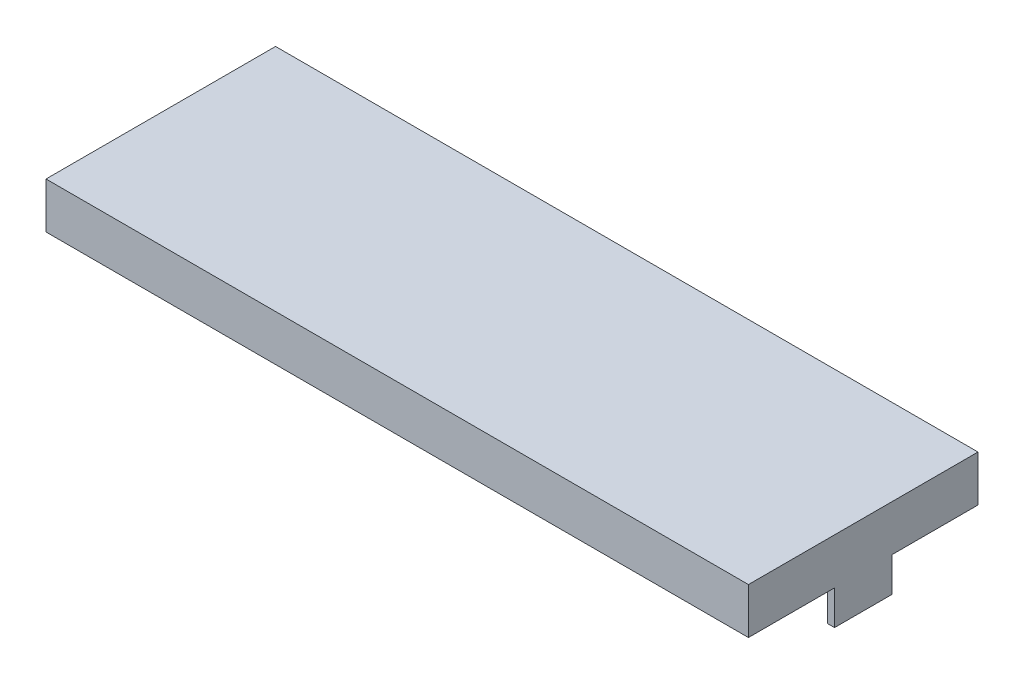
ISO-10303-21;
HEADER;
FILE_DESCRIPTION(('STEP AP214'),'2;1');
FILE_NAME('part.step','',(''),(''),'','','');
FILE_SCHEMA(('AUTOMOTIVE_DESIGN { 1 0 10303 214 1 1 1 1 }'));
ENDSEC;
DATA;
#1=APPLICATION_CONTEXT('core data for automotive mechanical design processes');
#2=APPLICATION_PROTOCOL_DEFINITION('international standard','automotive_design',2000,#1);
#3=PRODUCT_CONTEXT('',#1,'mechanical');
#4=PRODUCT('Part','Part','',(#3));
#5=PRODUCT_RELATED_PRODUCT_CATEGORY('part','',(#4));
#6=PRODUCT_DEFINITION_FORMATION('','',#4);
#7=PRODUCT_DEFINITION_CONTEXT('part definition',#1,'design');
#8=PRODUCT_DEFINITION('design','',#6,#7);
#9=PRODUCT_DEFINITION_SHAPE('','',#8);
#10=(LENGTH_UNIT() NAMED_UNIT(*) SI_UNIT(.MILLI.,.METRE.));
#11=(NAMED_UNIT(*) PLANE_ANGLE_UNIT() SI_UNIT($,.RADIAN.));
#12=(NAMED_UNIT(*) SI_UNIT($,.STERADIAN.) SOLID_ANGLE_UNIT());
#13=UNCERTAINTY_MEASURE_WITH_UNIT(LENGTH_MEASURE(1.E-05),#10,'distance_accuracy_value','');
#14=(GEOMETRIC_REPRESENTATION_CONTEXT(3) GLOBAL_UNCERTAINTY_ASSIGNED_CONTEXT((#13)) GLOBAL_UNIT_ASSIGNED_CONTEXT((#10,
#11,#12)) REPRESENTATION_CONTEXT('',''));
#15=CARTESIAN_POINT('',(0.,0.,0.));
#16=DIRECTION('',(0.,0.,1.));
#17=DIRECTION('',(1.,0.,0.));
#18=AXIS2_PLACEMENT_3D('',#15,#16,#17);
#19=CARTESIAN_POINT('',(-153.,-10.,50.));
#20=DIRECTION('',(0.,1.,0.));
#21=DIRECTION('',(0.,0.,1.));
#22=AXIS2_PLACEMENT_3D('',#19,#20,#21);
#23=PLANE('',#22);
#24=DIRECTION('',(-1.,0.,0.));
#25=VECTOR('',#24,1.);
#26=CARTESIAN_POINT('',(153.,-10.,12.5));
#27=LINE('',#26,#25);
#28=CARTESIAN_POINT('',(153.,-10.,12.5));
#29=VERTEX_POINT('',#28);
#30=CARTESIAN_POINT('',(150.,-10.,12.5));
#31=VERTEX_POINT('',#30);
#32=EDGE_CURVE('E241',#29,#31,#27,.T.);
#33=ORIENTED_EDGE('',*,*,#32,.F.);
#34=DIRECTION('',(0.,0.,-1.));
#35=VECTOR('',#34,1.);
#36=CARTESIAN_POINT('',(153.,-10.,50.));
#37=LINE('',#36,#35);
#38=CARTESIAN_POINT('',(153.,-10.,50.));
#39=VERTEX_POINT('',#38);
#40=EDGE_CURVE('E142',#39,#29,#37,.T.);
#41=ORIENTED_EDGE('',*,*,#40,.F.);
#42=DIRECTION('',(1.,0.,0.));
#43=VECTOR('',#42,1.);
#44=CARTESIAN_POINT('',(-153.,-10.,50.));
#45=LINE('',#44,#43);
#46=CARTESIAN_POINT('',(-153.,-10.,50.));
#47=VERTEX_POINT('',#46);
#48=EDGE_CURVE('E192',#47,#39,#45,.T.);
#49=ORIENTED_EDGE('',*,*,#48,.F.);
#50=DIRECTION('',(0.,0.,-1.));
#51=VECTOR('',#50,1.);
#52=CARTESIAN_POINT('',(-153.,-10.,50.));
#53=LINE('',#52,#51);
#54=CARTESIAN_POINT('',(-153.,-10.,12.5));
#55=VERTEX_POINT('',#54);
#56=EDGE_CURVE('E11',#47,#55,#53,.T.);
#57=ORIENTED_EDGE('',*,*,#56,.T.);
#58=DIRECTION('',(-1.,0.,0.));
#59=VECTOR('',#58,1.);
#60=CARTESIAN_POINT('',(-153.,-10.,12.5));
#61=LINE('',#60,#59);
#62=CARTESIAN_POINT('',(-150.,-10.,12.5));
#63=VERTEX_POINT('',#62);
#64=EDGE_CURVE('E54',#63,#55,#61,.T.);
#65=ORIENTED_EDGE('',*,*,#64,.F.);
#66=DIRECTION('',(0.,0.,1.));
#67=VECTOR('',#66,1.);
#68=CARTESIAN_POINT('',(-150.,-10.,-12.5));
#69=LINE('',#68,#67);
#70=CARTESIAN_POINT('',(-150.,-10.,-12.5));
#71=VERTEX_POINT('',#70);
#72=EDGE_CURVE('E146',#71,#63,#69,.T.);
#73=ORIENTED_EDGE('',*,*,#72,.F.);
#74=DIRECTION('',(1.,0.,0.));
#75=VECTOR('',#74,1.);
#76=CARTESIAN_POINT('',(-153.,-10.,-12.5));
#77=LINE('',#76,#75);
#78=CARTESIAN_POINT('',(-153.,-10.,-12.5));
#79=VERTEX_POINT('',#78);
#80=EDGE_CURVE('E143',#79,#71,#77,.T.);
#81=ORIENTED_EDGE('',*,*,#80,.F.);
#82=CARTESIAN_POINT('',(-153.,-10.,-50.));
#83=VERTEX_POINT('',#82);
#84=EDGE_CURVE('E39',#79,#83,#53,.T.);
#85=ORIENTED_EDGE('',*,*,#84,.T.);
#86=DIRECTION('',(1.,0.,0.));
#87=VECTOR('',#86,1.);
#88=CARTESIAN_POINT('',(-153.,-10.,-50.));
#89=LINE('',#88,#87);
#90=CARTESIAN_POINT('',(153.,-10.,-50.));
#91=VERTEX_POINT('',#90);
#92=EDGE_CURVE('E202',#83,#91,#89,.T.);
#93=ORIENTED_EDGE('',*,*,#92,.T.);
#94=CARTESIAN_POINT('',(153.,-10.,-12.5));
#95=VERTEX_POINT('',#94);
#96=EDGE_CURVE('E213',#95,#91,#37,.T.);
#97=ORIENTED_EDGE('',*,*,#96,.F.);
#98=DIRECTION('',(1.,0.,0.));
#99=VECTOR('',#98,1.);
#100=CARTESIAN_POINT('',(153.,-10.,-12.5));
#101=LINE('',#100,#99);
#102=CARTESIAN_POINT('',(150.,-10.,-12.5));
#103=VERTEX_POINT('',#102);
#104=EDGE_CURVE('E136',#103,#95,#101,.T.);
#105=ORIENTED_EDGE('',*,*,#104,.F.);
#106=DIRECTION('',(0.,0.,-1.));
#107=VECTOR('',#106,1.);
#108=CARTESIAN_POINT('',(150.,-10.,-12.5));
#109=LINE('',#108,#107);
#110=EDGE_CURVE('E237',#31,#103,#109,.T.);
#111=ORIENTED_EDGE('',*,*,#110,.F.);
#112=EDGE_LOOP('',(#33,#41,#49,#57,#65,#73,#81,#85,#93,#97,#105,#111));
#113=FACE_BOUND('',#112,.T.);
#114=ADVANCED_FACE('F30',(#113),#23,.F.);
#115=CARTESIAN_POINT('',(-153.,-10.,50.));
#116=DIRECTION('',(1.,0.,0.));
#117=DIRECTION('',(0.,0.,-1.));
#118=AXIS2_PLACEMENT_3D('',#115,#116,#117);
#119=PLANE('',#118);
#120=DIRECTION('',(0.,-1.,0.));
#121=VECTOR('',#120,1.);
#122=CARTESIAN_POINT('',(-153.,-10.,-50.));
#123=LINE('',#122,#121);
#124=CARTESIAN_POINT('',(-153.,10.,-50.));
#125=VERTEX_POINT('',#124);
#126=EDGE_CURVE('E187',#125,#83,#123,.T.);
#127=ORIENTED_EDGE('',*,*,#126,.T.);
#128=ORIENTED_EDGE('',*,*,#84,.F.);
#129=DIRECTION('',(0.,1.,0.));
#130=VECTOR('',#129,1.);
#131=CARTESIAN_POINT('',(-153.,-25.,-12.5));
#132=LINE('',#131,#130);
#133=CARTESIAN_POINT('',(-153.,-25.,-12.5));
#134=VERTEX_POINT('',#133);
#135=EDGE_CURVE('E182',#134,#79,#132,.T.);
#136=ORIENTED_EDGE('',*,*,#135,.F.);
#137=DIRECTION('',(0.,0.,-1.));
#138=VECTOR('',#137,1.);
#139=CARTESIAN_POINT('',(-153.,-25.,-12.5));
#140=LINE('',#139,#138);
#141=CARTESIAN_POINT('',(-153.,-25.,12.5));
#142=VERTEX_POINT('',#141);
#143=EDGE_CURVE('E152',#142,#134,#140,.T.);
#144=ORIENTED_EDGE('',*,*,#143,.F.);
#145=DIRECTION('',(0.,1.,0.));
#146=VECTOR('',#145,1.);
#147=CARTESIAN_POINT('',(-153.,-25.,12.5));
#148=LINE('',#147,#146);
#149=EDGE_CURVE('E161',#142,#55,#148,.T.);
#150=ORIENTED_EDGE('',*,*,#149,.T.);
#151=ORIENTED_EDGE('',*,*,#56,.F.);
#152=DIRECTION('',(0.,-1.,0.));
#153=VECTOR('',#152,1.);
#154=CARTESIAN_POINT('',(-153.,-10.,50.));
#155=LINE('',#154,#153);
#156=CARTESIAN_POINT('',(-153.,10.,50.));
#157=VERTEX_POINT('',#156);
#158=EDGE_CURVE('E189',#157,#47,#155,.T.);
#159=ORIENTED_EDGE('',*,*,#158,.F.);
#160=DIRECTION('',(0.,0.,-1.));
#161=VECTOR('',#160,1.);
#162=CARTESIAN_POINT('',(-153.,10.,50.));
#163=LINE('',#162,#161);
#164=EDGE_CURVE('E199',#157,#125,#163,.T.);
#165=ORIENTED_EDGE('',*,*,#164,.T.);
#166=EDGE_LOOP('',(#127,#128,#136,#144,#150,#151,#159,#165));
#167=FACE_BOUND('',#166,.T.);
#168=ADVANCED_FACE('F32',(#167),#119,.F.);
#169=CARTESIAN_POINT('',(153.,-10.,50.));
#170=DIRECTION('',(-1.,0.,0.));
#171=DIRECTION('',(0.,0.,1.));
#172=AXIS2_PLACEMENT_3D('',#169,#170,#171);
#173=PLANE('',#172);
#174=DIRECTION('',(0.,1.,0.));
#175=VECTOR('',#174,1.);
#176=CARTESIAN_POINT('',(153.,-10.,-50.));
#177=LINE('',#176,#175);
#178=CARTESIAN_POINT('',(153.,10.,-50.));
#179=VERTEX_POINT('',#178);
#180=EDGE_CURVE('E205',#91,#179,#177,.T.);
#181=ORIENTED_EDGE('',*,*,#180,.T.);
#182=DIRECTION('',(0.,0.,-1.));
#183=VECTOR('',#182,1.);
#184=CARTESIAN_POINT('',(153.,10.,50.));
#185=LINE('',#184,#183);
#186=CARTESIAN_POINT('',(153.,10.,50.));
#187=VERTEX_POINT('',#186);
#188=EDGE_CURVE('E210',#187,#179,#185,.T.);
#189=ORIENTED_EDGE('',*,*,#188,.F.);
#190=DIRECTION('',(0.,1.,0.));
#191=VECTOR('',#190,1.);
#192=CARTESIAN_POINT('',(153.,-10.,50.));
#193=LINE('',#192,#191);
#194=EDGE_CURVE('E195',#39,#187,#193,.T.);
#195=ORIENTED_EDGE('',*,*,#194,.F.);
#196=ORIENTED_EDGE('',*,*,#40,.T.);
#197=DIRECTION('',(0.,1.,0.));
#198=VECTOR('',#197,1.);
#199=CARTESIAN_POINT('',(153.,-25.,12.5));
#200=LINE('',#199,#198);
#201=CARTESIAN_POINT('',(153.,-25.,12.5));
#202=VERTEX_POINT('',#201);
#203=EDGE_CURVE('E124',#202,#29,#200,.T.);
#204=ORIENTED_EDGE('',*,*,#203,.F.);
#205=DIRECTION('',(0.,0.,1.));
#206=VECTOR('',#205,1.);
#207=CARTESIAN_POINT('',(153.,-25.,-12.5));
#208=LINE('',#207,#206);
#209=CARTESIAN_POINT('',(153.,-25.,-12.5));
#210=VERTEX_POINT('',#209);
#211=EDGE_CURVE('E131',#210,#202,#208,.T.);
#212=ORIENTED_EDGE('',*,*,#211,.F.);
#213=DIRECTION('',(0.,1.,0.));
#214=VECTOR('',#213,1.);
#215=CARTESIAN_POINT('',(153.,-25.,-12.5));
#216=LINE('',#215,#214);
#217=EDGE_CURVE('E47',#210,#95,#216,.T.);
#218=ORIENTED_EDGE('',*,*,#217,.T.);
#219=ORIENTED_EDGE('',*,*,#96,.T.);
#220=EDGE_LOOP('',(#181,#189,#195,#196,#204,#212,#218,#219));
#221=FACE_BOUND('',#220,.T.);
#222=ADVANCED_FACE('F139',(#221),#173,.F.);
#223=CARTESIAN_POINT('',(-153.,10.,50.));
#224=DIRECTION('',(0.,-1.,0.));
#225=DIRECTION('',(0.,0.,-1.));
#226=AXIS2_PLACEMENT_3D('',#223,#224,#225);
#227=PLANE('',#226);
#228=DIRECTION('',(-1.,0.,0.));
#229=VECTOR('',#228,1.);
#230=CARTESIAN_POINT('',(-153.,10.,-50.));
#231=LINE('',#230,#229);
#232=EDGE_CURVE('E193',#179,#125,#231,.T.);
#233=ORIENTED_EDGE('',*,*,#232,.T.);
#234=ORIENTED_EDGE('',*,*,#164,.F.);
#235=DIRECTION('',(-1.,0.,0.));
#236=VECTOR('',#235,1.);
#237=CARTESIAN_POINT('',(-153.,10.,50.));
#238=LINE('',#237,#236);
#239=EDGE_CURVE('E197',#187,#157,#238,.T.);
#240=ORIENTED_EDGE('',*,*,#239,.F.);
#241=ORIENTED_EDGE('',*,*,#188,.T.);
#242=EDGE_LOOP('',(#233,#234,#240,#241));
#243=FACE_BOUND('',#242,.T.);
#244=ADVANCED_FACE('F233',(#243),#227,.F.);
#245=CARTESIAN_POINT('',(-153.,10.,50.));
#246=DIRECTION('',(0.,0.,-1.));
#247=DIRECTION('',(-1.,0.,0.));
#248=AXIS2_PLACEMENT_3D('',#245,#246,#247);
#249=PLANE('',#248);
#250=ORIENTED_EDGE('',*,*,#158,.T.);
#251=ORIENTED_EDGE('',*,*,#48,.T.);
#252=ORIENTED_EDGE('',*,*,#194,.T.);
#253=ORIENTED_EDGE('',*,*,#239,.T.);
#254=EDGE_LOOP('',(#250,#251,#252,#253));
#255=FACE_BOUND('',#254,.T.);
#256=ADVANCED_FACE('F252',(#255),#249,.F.);
#257=CARTESIAN_POINT('',(-153.,10.,-50.));
#258=DIRECTION('',(0.,0.,-1.));
#259=DIRECTION('',(-1.,0.,0.));
#260=AXIS2_PLACEMENT_3D('',#257,#258,#259);
#261=PLANE('',#260);
#262=ORIENTED_EDGE('',*,*,#126,.F.);
#263=ORIENTED_EDGE('',*,*,#232,.F.);
#264=ORIENTED_EDGE('',*,*,#180,.F.);
#265=ORIENTED_EDGE('',*,*,#92,.F.);
#266=EDGE_LOOP('',(#262,#263,#264,#265));
#267=FACE_BOUND('',#266,.T.);
#268=ADVANCED_FACE('F227',(#267),#261,.T.);
#269=CARTESIAN_POINT('',(-153.,-25.,-12.5));
#270=DIRECTION('',(0.,0.,1.));
#271=DIRECTION('',(1.,0.,0.));
#272=AXIS2_PLACEMENT_3D('',#269,#270,#271);
#273=PLANE('',#272);
#274=ORIENTED_EDGE('',*,*,#80,.T.);
#275=DIRECTION('',(0.,1.,0.));
#276=VECTOR('',#275,1.);
#277=CARTESIAN_POINT('',(-150.,-25.,-12.5));
#278=LINE('',#277,#276);
#279=CARTESIAN_POINT('',(-150.,-25.,-12.5));
#280=VERTEX_POINT('',#279);
#281=EDGE_CURVE('E177',#280,#71,#278,.T.);
#282=ORIENTED_EDGE('',*,*,#281,.F.);
#283=DIRECTION('',(1.,0.,0.));
#284=VECTOR('',#283,1.);
#285=CARTESIAN_POINT('',(-153.,-25.,-12.5));
#286=LINE('',#285,#284);
#287=EDGE_CURVE('E155',#134,#280,#286,.T.);
#288=ORIENTED_EDGE('',*,*,#287,.F.);
#289=ORIENTED_EDGE('',*,*,#135,.T.);
#290=EDGE_LOOP('',(#274,#282,#288,#289));
#291=FACE_BOUND('',#290,.T.);
#292=ADVANCED_FACE('F259',(#291),#273,.F.);
#293=CARTESIAN_POINT('',(-150.,-25.,-12.5));
#294=DIRECTION('',(-1.,0.,0.));
#295=DIRECTION('',(0.,0.,1.));
#296=AXIS2_PLACEMENT_3D('',#293,#294,#295);
#297=PLANE('',#296);
#298=ORIENTED_EDGE('',*,*,#72,.T.);
#299=DIRECTION('',(0.,1.,0.));
#300=VECTOR('',#299,1.);
#301=CARTESIAN_POINT('',(-150.,-25.,12.5));
#302=LINE('',#301,#300);
#303=CARTESIAN_POINT('',(-150.,-25.,12.5));
#304=VERTEX_POINT('',#303);
#305=EDGE_CURVE('E165',#304,#63,#302,.T.);
#306=ORIENTED_EDGE('',*,*,#305,.F.);
#307=DIRECTION('',(0.,0.,1.));
#308=VECTOR('',#307,1.);
#309=CARTESIAN_POINT('',(-150.,-25.,-12.5));
#310=LINE('',#309,#308);
#311=EDGE_CURVE('E157',#280,#304,#310,.T.);
#312=ORIENTED_EDGE('',*,*,#311,.F.);
#313=ORIENTED_EDGE('',*,*,#281,.T.);
#314=EDGE_LOOP('',(#298,#306,#312,#313));
#315=FACE_BOUND('',#314,.T.);
#316=ADVANCED_FACE('F313',(#315),#297,.F.);
#317=CARTESIAN_POINT('',(-153.,-25.,12.5));
#318=DIRECTION('',(0.,0.,-1.));
#319=DIRECTION('',(-1.,0.,0.));
#320=AXIS2_PLACEMENT_3D('',#317,#318,#319);
#321=PLANE('',#320);
#322=ORIENTED_EDGE('',*,*,#64,.T.);
#323=ORIENTED_EDGE('',*,*,#149,.F.);
#324=DIRECTION('',(-1.,0.,0.));
#325=VECTOR('',#324,1.);
#326=CARTESIAN_POINT('',(-153.,-25.,12.5));
#327=LINE('',#326,#325);
#328=EDGE_CURVE('E159',#304,#142,#327,.T.);
#329=ORIENTED_EDGE('',*,*,#328,.F.);
#330=ORIENTED_EDGE('',*,*,#305,.T.);
#331=EDGE_LOOP('',(#322,#323,#329,#330));
#332=FACE_BOUND('',#331,.T.);
#333=ADVANCED_FACE('F321',(#332),#321,.F.);
#334=CARTESIAN_POINT('',(-153.,-25.,12.5));
#335=DIRECTION('',(0.,1.,0.));
#336=DIRECTION('',(0.,0.,1.));
#337=AXIS2_PLACEMENT_3D('',#334,#335,#336);
#338=PLANE('',#337);
#339=ORIENTED_EDGE('',*,*,#143,.T.);
#340=ORIENTED_EDGE('',*,*,#287,.T.);
#341=ORIENTED_EDGE('',*,*,#311,.T.);
#342=ORIENTED_EDGE('',*,*,#328,.T.);
#343=EDGE_LOOP('',(#339,#340,#341,#342));
#344=FACE_BOUND('',#343,.T.);
#345=ADVANCED_FACE('F329',(#344),#338,.F.);
#346=CARTESIAN_POINT('',(153.,-25.,12.5));
#347=DIRECTION('',(0.,0.,-1.));
#348=DIRECTION('',(-1.,0.,0.));
#349=AXIS2_PLACEMENT_3D('',#346,#347,#348);
#350=PLANE('',#349);
#351=ORIENTED_EDGE('',*,*,#32,.T.);
#352=DIRECTION('',(0.,1.,0.));
#353=VECTOR('',#352,1.);
#354=CARTESIAN_POINT('',(150.,-25.,12.5));
#355=LINE('',#354,#353);
#356=CARTESIAN_POINT('',(150.,-25.,12.5));
#357=VERTEX_POINT('',#356);
#358=EDGE_CURVE('E127',#357,#31,#355,.T.);
#359=ORIENTED_EDGE('',*,*,#358,.F.);
#360=DIRECTION('',(-1.,0.,0.));
#361=VECTOR('',#360,1.);
#362=CARTESIAN_POINT('',(153.,-25.,12.5));
#363=LINE('',#362,#361);
#364=EDGE_CURVE('E120',#202,#357,#363,.T.);
#365=ORIENTED_EDGE('',*,*,#364,.F.);
#366=ORIENTED_EDGE('',*,*,#203,.T.);
#367=EDGE_LOOP('',(#351,#359,#365,#366));
#368=FACE_BOUND('',#367,.T.);
#369=ADVANCED_FACE('F122',(#368),#350,.F.);
#370=CARTESIAN_POINT('',(150.,-25.,-12.5));
#371=DIRECTION('',(1.,0.,0.));
#372=DIRECTION('',(0.,0.,-1.));
#373=AXIS2_PLACEMENT_3D('',#370,#371,#372);
#374=PLANE('',#373);
#375=ORIENTED_EDGE('',*,*,#110,.T.);
#376=DIRECTION('',(0.,1.,0.));
#377=VECTOR('',#376,1.);
#378=CARTESIAN_POINT('',(150.,-25.,-12.5));
#379=LINE('',#378,#377);
#380=CARTESIAN_POINT('',(150.,-25.,-12.5));
#381=VERTEX_POINT('',#380);
#382=EDGE_CURVE('E148',#381,#103,#379,.T.);
#383=ORIENTED_EDGE('',*,*,#382,.F.);
#384=DIRECTION('',(0.,0.,-1.));
#385=VECTOR('',#384,1.);
#386=CARTESIAN_POINT('',(150.,-25.,-12.5));
#387=LINE('',#386,#385);
#388=EDGE_CURVE('E130',#357,#381,#387,.T.);
#389=ORIENTED_EDGE('',*,*,#388,.F.);
#390=ORIENTED_EDGE('',*,*,#358,.T.);
#391=EDGE_LOOP('',(#375,#383,#389,#390));
#392=FACE_BOUND('',#391,.T.);
#393=ADVANCED_FACE('F248',(#392),#374,.F.);
#394=CARTESIAN_POINT('',(153.,-25.,-12.5));
#395=DIRECTION('',(0.,0.,1.));
#396=DIRECTION('',(1.,0.,0.));
#397=AXIS2_PLACEMENT_3D('',#394,#395,#396);
#398=PLANE('',#397);
#399=ORIENTED_EDGE('',*,*,#104,.T.);
#400=ORIENTED_EDGE('',*,*,#217,.F.);
#401=DIRECTION('',(1.,0.,0.));
#402=VECTOR('',#401,1.);
#403=CARTESIAN_POINT('',(153.,-25.,-12.5));
#404=LINE('',#403,#402);
#405=EDGE_CURVE('E135',#381,#210,#404,.T.);
#406=ORIENTED_EDGE('',*,*,#405,.F.);
#407=ORIENTED_EDGE('',*,*,#382,.T.);
#408=EDGE_LOOP('',(#399,#400,#406,#407));
#409=FACE_BOUND('',#408,.T.);
#410=ADVANCED_FACE('F246',(#409),#398,.F.);
#411=CARTESIAN_POINT('',(153.,-25.,12.5));
#412=DIRECTION('',(0.,-1.,0.));
#413=DIRECTION('',(0.,0.,-1.));
#414=AXIS2_PLACEMENT_3D('',#411,#412,#413);
#415=PLANE('',#414);
#416=ORIENTED_EDGE('',*,*,#211,.T.);
#417=ORIENTED_EDGE('',*,*,#364,.T.);
#418=ORIENTED_EDGE('',*,*,#388,.T.);
#419=ORIENTED_EDGE('',*,*,#405,.T.);
#420=EDGE_LOOP('',(#416,#417,#418,#419));
#421=FACE_BOUND('',#420,.T.);
#422=ADVANCED_FACE('F133',(#421),#415,.T.);
#423=CLOSED_SHELL('',(#114,#168,#222,#244,#256,#268,#292,#316,#333,#345,#369,#393,#410,#422));
#424=MANIFOLD_SOLID_BREP('B2',#423);
#425=ADVANCED_BREP_SHAPE_REPRESENTATION('',(#18,#424),#14);
#426=SHAPE_DEFINITION_REPRESENTATION(#9,#425);
ENDSEC;
END-ISO-10303-21;
